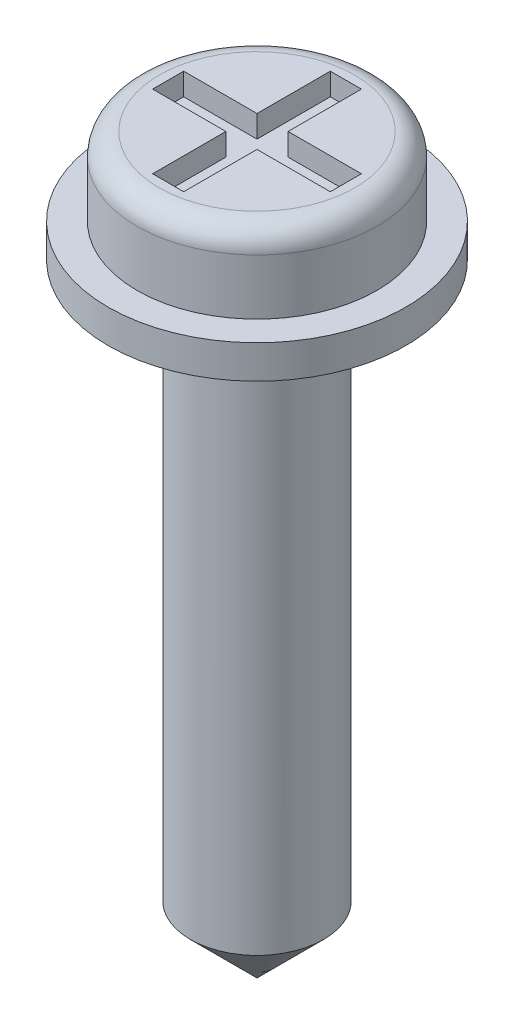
from build123d import *

# Parameters (mm, degrees)
CONG_1_R                = 0.5
ENL_V_MAT_EXTRU_1_DEPTH = 0.5


with BuildPart() as part:
    # Esquisse1 → R_volution1 (revolve)
    with BuildSketch(Plane.XY, mode=Mode.PRIVATE) as r_volution1_sk:
        Polygon((-1.5, 0), (-1.5, -12.5), (0, -14), (0, 2.5), (-2.7, 2.5), (-2.7, 0.75), (-3.35, 0.75), (-3.35, 0), align=None)
    revolve(r_volution1_sk.sketch.rotate(Axis((0, 0, 0), (0, 1, 0)), 270), axis=Axis((0, 0, 0), (0, 1, 0)))

    # Cong_1
    cong_1_edges = [part.edges().sort_by_distance(p)[0] for p in [
        (0, 2.5, 2.7),
    ]]
    fillet(cong_1_edges, radius=CONG_1_R)

    # Esquisse2 → Enl_v. mat.-Extru.1 (cut)
    with BuildSketch(Plane(origin=(0, 2.5, 0), x_dir=(1, 0, 0), z_dir=(0, 1, 0))):
        Polygon((-2, 0.35), (-0.35, 0.35), (-0.35, 2), (0.35, 2), (0.35, 0.35), (2, 0.35), (2, -0.35), (0.35, -0.35), (0.35, -2), (-0.35, -2), (-0.35, -0.35), (-2, -0.35), align=None)
    extrude(amount=-ENL_V_MAT_EXTRU_1_DEPTH, mode=Mode.SUBTRACT)


solid = part.part
